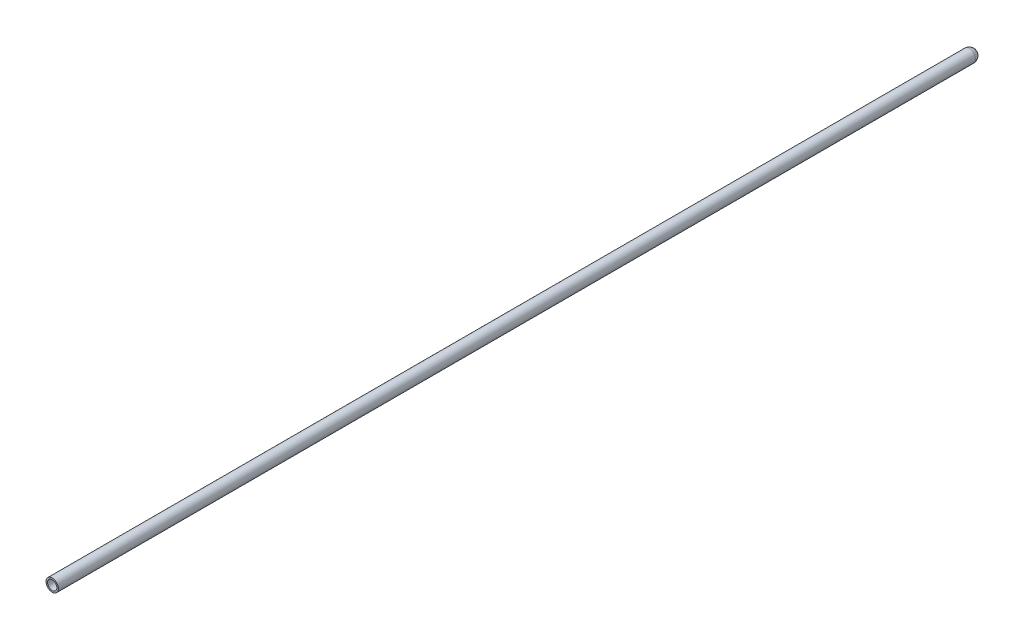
from build123d import *


with BuildPart() as part:
    # Sketch3 → Revolve1 (revolve)
    with BuildSketch(Plane(origin=(0, 0, 0), x_dir=(0, 0, -1), z_dir=(1, 0, 0)), mode=Mode.PRIVATE) as revolve1_sk:
        with BuildLine():
            Line((0, 1.5), (0, 2))
            Line((0, 2), (295.1692, 2))
            ThreePointArc((295.1692, 2), (296.583413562, 1.414213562), (297.1692, 0))
            Line((297.1692, 0), (296.6692, 0))
            ThreePointArc((296.6692, 0), (296.229860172, 1.060660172), (295.1692, 1.5))
            Line((295.1692, 1.5), (0, 1.5))
        make_face()
    revolve(revolve1_sk.sketch.rotate(Axis((0, 0, 0), (0, 0, -1)), 90), axis=Axis((0, 0, 0), (0, 0, -1)))


solid = part.part
